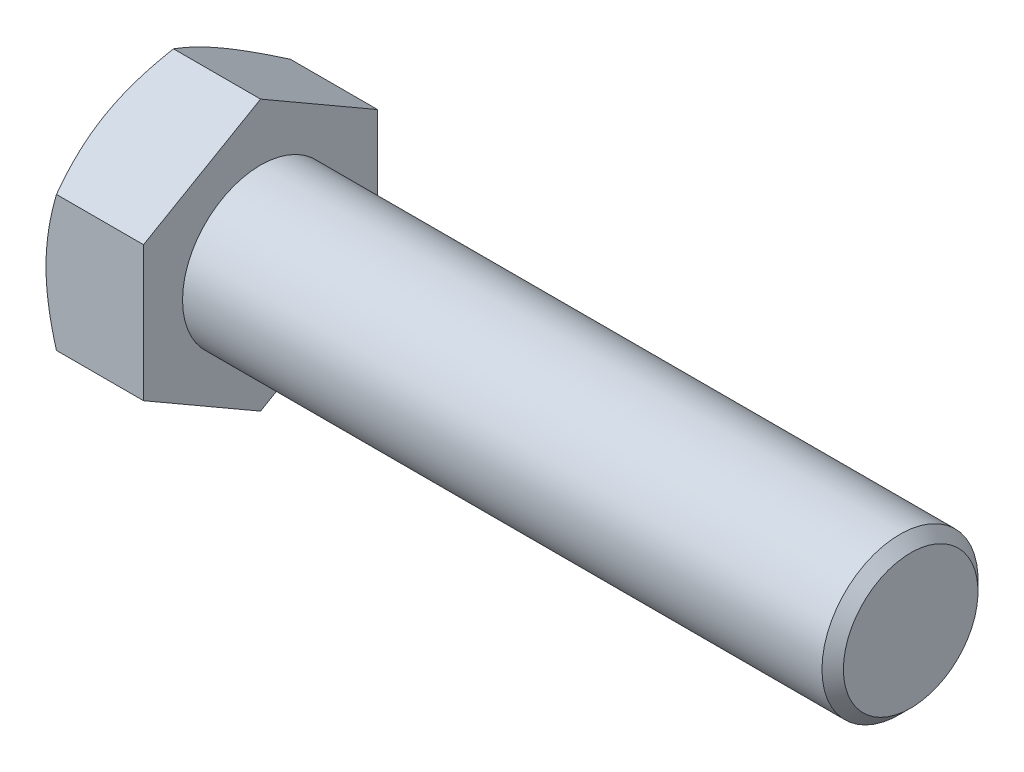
from build123d import *

# Parameters (mm, degrees)
BASEHEAD_DEPTH = 15


with BuildPart() as part:
    # Sketch1 → BaseHead (new body)
    with BuildSketch(Plane(origin=(0, 0, 0), x_dir=(0, 0, -1), z_dir=(1, 0, 0))):
        Polygon((18, 10.392304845), (18, -10.392304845), (0, -20.784609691), (-18, -10.392304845), (-18, 10.392304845), (0, 20.784609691), align=None)
    extrude(amount=BASEHEAD_DEPTH)

    # BodySke → BaseBody (revolve)
    with BuildSketch(Plane.XY, mode=Mode.PRIVATE) as basebody_sk:
        Polygon((0, 0), (115, 0), (115, 10.352), (113.352, 12), (0, 12), align=None)
    revolve(basebody_sk.sketch.rotate(Axis((0, 0, 0), (1, 0, 0)), 90), axis=Axis((0, 0, 0), (1, 0, 0)))

    # Sketch3 → HeadChamfer (revolve, cut)
    with BuildSketch(Plane.XY):
        Polygon((0, 18), (4.494446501, 25.784609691), (4.494446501, 30.784609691), (-10, 30.784609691), (-10, 18), align=None)
    revolve(axis=Axis((0, 0, 0), (1, 0, 0)), mode=Mode.SUBTRACT)


solid = part.part
